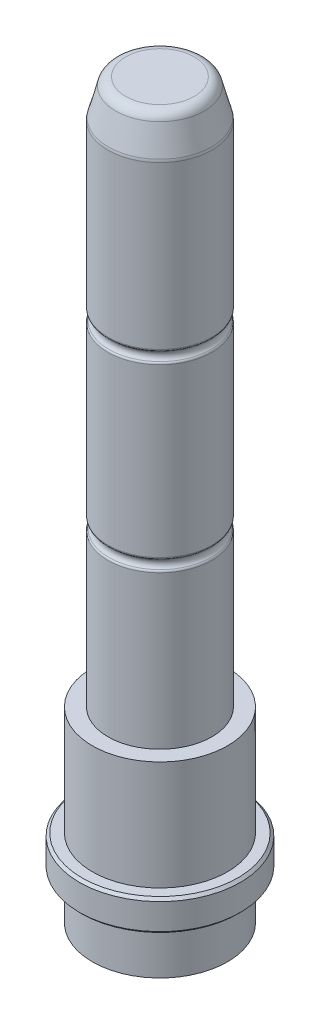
ISO-10303-21;
HEADER;
FILE_DESCRIPTION(('STEP AP214'),'2;1');
FILE_NAME('part.step','',(''),(''),'','','');
FILE_SCHEMA(('AUTOMOTIVE_DESIGN { 1 0 10303 214 1 1 1 1 }'));
ENDSEC;
DATA;
#1=APPLICATION_CONTEXT('core data for automotive mechanical design processes');
#2=APPLICATION_PROTOCOL_DEFINITION('international standard','automotive_design',2000,#1);
#3=PRODUCT_CONTEXT('',#1,'mechanical');
#4=PRODUCT('Part','Part','',(#3));
#5=PRODUCT_RELATED_PRODUCT_CATEGORY('part','',(#4));
#6=PRODUCT_DEFINITION_FORMATION('','',#4);
#7=PRODUCT_DEFINITION_CONTEXT('part definition',#1,'design');
#8=PRODUCT_DEFINITION('design','',#6,#7);
#9=PRODUCT_DEFINITION_SHAPE('','',#8);
#10=(LENGTH_UNIT() NAMED_UNIT(*) SI_UNIT(.MILLI.,.METRE.));
#11=(NAMED_UNIT(*) PLANE_ANGLE_UNIT() SI_UNIT($,.RADIAN.));
#12=(NAMED_UNIT(*) SI_UNIT($,.STERADIAN.) SOLID_ANGLE_UNIT());
#13=UNCERTAINTY_MEASURE_WITH_UNIT(LENGTH_MEASURE(1.E-05),#10,'distance_accuracy_value','');
#14=(GEOMETRIC_REPRESENTATION_CONTEXT(3) GLOBAL_UNCERTAINTY_ASSIGNED_CONTEXT((#13)) GLOBAL_UNIT_ASSIGNED_CONTEXT((#10,
#11,#12)) REPRESENTATION_CONTEXT('',''));
#15=CARTESIAN_POINT('',(0.,0.,0.));
#16=DIRECTION('',(0.,0.,1.));
#17=DIRECTION('',(1.,0.,0.));
#18=AXIS2_PLACEMENT_3D('',#15,#16,#17);
#19=CARTESIAN_POINT('',(0.,6.,0.));
#20=DIRECTION('',(0.,-1.,0.));
#21=DIRECTION('',(0.,0.,-1.));
#22=AXIS2_PLACEMENT_3D('',#19,#20,#21);
#23=CYLINDRICAL_SURFACE('',#22,15.5);
#24=CARTESIAN_POINT('',(0.,5.5,0.));
#25=DIRECTION('',(0.,1.,0.));
#26=DIRECTION('',(0.,0.,1.));
#27=AXIS2_PLACEMENT_3D('',#24,#25,#26);
#28=CIRCLE('',#27,15.5);
#29=CARTESIAN_POINT('',(0.,5.5,15.5));
#30=VERTEX_POINT('',#29);
#31=EDGE_CURVE('E22',#30,#30,#28,.F.);
#32=ORIENTED_EDGE('',*,*,#31,.T.);
#33=EDGE_LOOP('',(#32));
#34=FACE_BOUND('',#33,.T.);
#35=CARTESIAN_POINT('',(0.,0.5,0.));
#36=DIRECTION('',(0.,1.,0.));
#37=DIRECTION('',(0.,0.,1.));
#38=AXIS2_PLACEMENT_3D('',#35,#36,#37);
#39=CIRCLE('',#38,15.5);
#40=CARTESIAN_POINT('',(0.,0.5,15.5));
#41=VERTEX_POINT('',#40);
#42=EDGE_CURVE('E29',#41,#41,#39,.T.);
#43=ORIENTED_EDGE('',*,*,#42,.T.);
#44=EDGE_LOOP('',(#43));
#45=FACE_BOUND('',#44,.T.);
#46=ADVANCED_FACE('F14',(#34,#45),#23,.T.);
#47=CARTESIAN_POINT('',(0.,6.,0.));
#48=DIRECTION('',(0.,1.,0.));
#49=DIRECTION('',(0.,0.,1.));
#50=AXIS2_PLACEMENT_3D('',#47,#48,#49);
#51=PLANE('',#50);
#52=CARTESIAN_POINT('',(0.,6.,0.));
#53=DIRECTION('',(0.,1.,0.));
#54=DIRECTION('',(0.,0.,1.));
#55=AXIS2_PLACEMENT_3D('',#52,#53,#54);
#56=CIRCLE('',#55,15.);
#57=CARTESIAN_POINT('',(0.,6.,15.));
#58=VERTEX_POINT('',#57);
#59=EDGE_CURVE('E34',#58,#58,#56,.T.);
#60=ORIENTED_EDGE('',*,*,#59,.T.);
#61=EDGE_LOOP('',(#60));
#62=FACE_BOUND('',#61,.T.);
#63=CARTESIAN_POINT('',(0.,6.,0.));
#64=DIRECTION('',(0.,-1.,0.));
#65=DIRECTION('',(0.,0.,-1.));
#66=AXIS2_PLACEMENT_3D('',#63,#64,#65);
#67=CIRCLE('',#66,13.);
#68=CARTESIAN_POINT('',(0.,6.,-13.));
#69=VERTEX_POINT('',#68);
#70=EDGE_CURVE('E44',#69,#69,#67,.T.);
#71=ORIENTED_EDGE('',*,*,#70,.T.);
#72=EDGE_LOOP('',(#71));
#73=FACE_BOUND('',#72,.T.);
#74=ADVANCED_FACE('F125',(#62,#73),#51,.T.);
#75=CARTESIAN_POINT('',(0.,0.,0.));
#76=DIRECTION('',(0.,1.,0.));
#77=DIRECTION('',(0.,0.,1.));
#78=AXIS2_PLACEMENT_3D('',#75,#76,#77);
#79=PLANE('',#78);
#80=CARTESIAN_POINT('',(0.,0.,0.));
#81=DIRECTION('',(0.,1.,0.));
#82=DIRECTION('',(0.,0.,1.));
#83=AXIS2_PLACEMENT_3D('',#80,#81,#82);
#84=CIRCLE('',#83,15.);
#85=CARTESIAN_POINT('',(0.,0.,15.));
#86=VERTEX_POINT('',#85);
#87=EDGE_CURVE('E9',#86,#86,#84,.F.);
#88=ORIENTED_EDGE('',*,*,#87,.T.);
#89=EDGE_LOOP('',(#88));
#90=FACE_BOUND('',#89,.T.);
#91=CARTESIAN_POINT('',(0.,0.,0.));
#92=DIRECTION('',(0.,1.,0.));
#93=DIRECTION('',(0.,0.,1.));
#94=AXIS2_PLACEMENT_3D('',#91,#92,#93);
#95=CIRCLE('',#94,13.);
#96=CARTESIAN_POINT('',(0.,0.,13.));
#97=VERTEX_POINT('',#96);
#98=EDGE_CURVE('E103',#97,#97,#95,.T.);
#99=ORIENTED_EDGE('',*,*,#98,.T.);
#100=EDGE_LOOP('',(#99));
#101=FACE_BOUND('',#100,.T.);
#102=ADVANCED_FACE('F108',(#90,#101),#79,.F.);
#103=CARTESIAN_POINT('',(0.,27.,0.));
#104=DIRECTION('',(0.,-1.,0.));
#105=DIRECTION('',(0.,0.,-1.));
#106=AXIS2_PLACEMENT_3D('',#103,#104,#105);
#107=PLANE('',#106);
#108=CARTESIAN_POINT('',(0.,27.,0.));
#109=DIRECTION('',(0.,1.,0.));
#110=DIRECTION('',(0.,0.,1.));
#111=AXIS2_PLACEMENT_3D('',#108,#109,#110);
#112=CIRCLE('',#111,10.);
#113=CARTESIAN_POINT('',(0.,27.,9.99999999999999));
#114=VERTEX_POINT('',#113);
#115=EDGE_CURVE('E40',#114,#114,#112,.T.);
#116=ORIENTED_EDGE('',*,*,#115,.F.);
#117=EDGE_LOOP('',(#116));
#118=FACE_BOUND('',#117,.T.);
#119=CARTESIAN_POINT('',(0.,27.,0.));
#120=DIRECTION('',(0.,-1.,0.));
#121=DIRECTION('',(0.,0.,-1.));
#122=AXIS2_PLACEMENT_3D('',#119,#120,#121);
#123=CIRCLE('',#122,13.);
#124=CARTESIAN_POINT('',(0.,27.,-13.));
#125=VERTEX_POINT('',#124);
#126=EDGE_CURVE('E41',#125,#125,#123,.T.);
#127=ORIENTED_EDGE('',*,*,#126,.F.);
#128=EDGE_LOOP('',(#127));
#129=FACE_BOUND('',#128,.T.);
#130=ADVANCED_FACE('F134',(#118,#129),#107,.F.);
#131=CARTESIAN_POINT('',(0.,6.,0.));
#132=DIRECTION('',(0.,-1.,0.));
#133=DIRECTION('',(0.,0.,-1.));
#134=AXIS2_PLACEMENT_3D('',#131,#132,#133);
#135=CYLINDRICAL_SURFACE('',#134,13.);
#136=ORIENTED_EDGE('',*,*,#70,.F.);
#137=EDGE_LOOP('',(#136));
#138=FACE_BOUND('',#137,.T.);
#139=ORIENTED_EDGE('',*,*,#126,.T.);
#140=EDGE_LOOP('',(#139));
#141=FACE_BOUND('',#140,.T.);
#142=ADVANCED_FACE('F138',(#138,#141),#135,.T.);
#143=CARTESIAN_POINT('',(0.,132.,0.));
#144=DIRECTION('',(0.,1.,0.));
#145=DIRECTION('',(0.,0.,1.));
#146=AXIS2_PLACEMENT_3D('',#143,#144,#145);
#147=PLANE('',#146);
#148=CARTESIAN_POINT('',(0.,132.,0.));
#149=DIRECTION('',(0.,1.,0.));
#150=DIRECTION('',(0.,0.,1.));
#151=AXIS2_PLACEMENT_3D('',#148,#149,#150);
#152=CIRCLE('',#151,6.58970167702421);
#153=CARTESIAN_POINT('',(0.,132.,6.58970167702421));
#154=VERTEX_POINT('',#153);
#155=EDGE_CURVE('E48',#154,#154,#152,.T.);
#156=ORIENTED_EDGE('',*,*,#155,.T.);
#157=EDGE_LOOP('',(#156));
#158=FACE_BOUND('',#157,.T.);
#159=ADVANCED_FACE('F142',(#158),#147,.T.);
#160=CARTESIAN_POINT('',(0.,130.,0.));
#161=DIRECTION('',(0.,1.,0.));
#162=DIRECTION('',(0.,0.,1.));
#163=AXIS2_PLACEMENT_3D('',#160,#161,#162);
#164=TOROIDAL_SURFACE('',#163,6.58970167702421,2.);
#165=CARTESIAN_POINT('',(0.,130.517638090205,0.));
#166=DIRECTION('',(0.,1.,0.));
#167=DIRECTION('',(0.,0.,1.));
#168=AXIS2_PLACEMENT_3D('',#165,#166,#167);
#169=CIRCLE('',#168,8.52155332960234);
#170=CARTESIAN_POINT('',(0.,130.517638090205,8.52155332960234));
#171=VERTEX_POINT('',#170);
#172=EDGE_CURVE('E52',#171,#171,#169,.T.);
#173=ORIENTED_EDGE('',*,*,#172,.T.);
#174=EDGE_LOOP('',(#173));
#175=FACE_BOUND('',#174,.T.);
#176=ORIENTED_EDGE('',*,*,#155,.F.);
#177=EDGE_LOOP('',(#176));
#178=FACE_BOUND('',#177,.T.);
#179=ADVANCED_FACE('F146',(#175,#178),#164,.T.);
#180=CARTESIAN_POINT('',(0.,130.517638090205,0.));
#181=DIRECTION('',(0.,-1.,0.));
#182=DIRECTION('',(0.,0.,-1.));
#183=AXIS2_PLACEMENT_3D('',#180,#181,#182);
#184=CONICAL_SURFACE('',#183,8.52155332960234,0.261799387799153);
#185=CARTESIAN_POINT('',(0.,125.25433309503,0.));
#186=DIRECTION('',(0.,1.,0.));
#187=DIRECTION('',(0.,0.,1.));
#188=AXIS2_PLACEMENT_3D('',#185,#186,#187);
#189=CIRCLE('',#188,9.93185165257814);
#190=CARTESIAN_POINT('',(0.,125.25433309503,9.93185165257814));
#191=VERTEX_POINT('',#190);
#192=EDGE_CURVE('E56',#191,#191,#189,.T.);
#193=ORIENTED_EDGE('',*,*,#192,.T.);
#194=EDGE_LOOP('',(#193));
#195=FACE_BOUND('',#194,.T.);
#196=ORIENTED_EDGE('',*,*,#172,.F.);
#197=EDGE_LOOP('',(#196));
#198=FACE_BOUND('',#197,.T.);
#199=ADVANCED_FACE('F150',(#195,#198),#184,.T.);
#200=CARTESIAN_POINT('',(0.,124.736695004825,0.));
#201=DIRECTION('',(0.,1.,0.));
#202=DIRECTION('',(0.,0.,1.));
#203=AXIS2_PLACEMENT_3D('',#200,#201,#202);
#204=TOROIDAL_SURFACE('',#203,8.,2.);
#205=CARTESIAN_POINT('',(0.,124.736695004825,0.));
#206=DIRECTION('',(0.,1.,0.));
#207=DIRECTION('',(0.,0.,1.));
#208=AXIS2_PLACEMENT_3D('',#205,#206,#207);
#209=CIRCLE('',#208,10.);
#210=CARTESIAN_POINT('',(0.,124.736695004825,10.));
#211=VERTEX_POINT('',#210);
#212=EDGE_CURVE('E60',#211,#211,#209,.T.);
#213=ORIENTED_EDGE('',*,*,#212,.T.);
#214=EDGE_LOOP('',(#213));
#215=FACE_BOUND('',#214,.T.);
#216=ORIENTED_EDGE('',*,*,#192,.F.);
#217=EDGE_LOOP('',(#216));
#218=FACE_BOUND('',#217,.T.);
#219=ADVANCED_FACE('F154',(#215,#218),#204,.T.);
#220=CARTESIAN_POINT('',(0.,132.,0.));
#221=DIRECTION('',(0.,1.,0.));
#222=DIRECTION('',(0.,0.,1.));
#223=AXIS2_PLACEMENT_3D('',#220,#221,#222);
#224=CYLINDRICAL_SURFACE('',#223,10.);
#225=CARTESIAN_POINT('',(0.,93.6053529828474,0.));
#226=DIRECTION('',(0.,1.,0.));
#227=DIRECTION('',(0.,0.,1.));
#228=AXIS2_PLACEMENT_3D('',#225,#226,#227);
#229=CIRCLE('',#228,10.);
#230=CARTESIAN_POINT('',(0.,93.6053529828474,10.));
#231=VERTEX_POINT('',#230);
#232=EDGE_CURVE('E64',#231,#231,#229,.T.);
#233=ORIENTED_EDGE('',*,*,#232,.T.);
#234=EDGE_LOOP('',(#233));
#235=FACE_BOUND('',#234,.T.);
#236=ORIENTED_EDGE('',*,*,#212,.F.);
#237=EDGE_LOOP('',(#236));
#238=FACE_BOUND('',#237,.T.);
#239=ADVANCED_FACE('F158',(#235,#238),#224,.T.);
#240=CARTESIAN_POINT('',(0.,93.6053529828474,0.));
#241=DIRECTION('',(0.,1.,0.));
#242=DIRECTION('',(0.,0.,1.));
#243=AXIS2_PLACEMENT_3D('',#240,#241,#242);
#244=TOROIDAL_SURFACE('',#243,9.5,0.5);
#245=CARTESIAN_POINT('',(0.,93.2122772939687,0.));
#246=DIRECTION('',(0.,1.,0.));
#247=DIRECTION('',(0.,0.,1.));
#248=AXIS2_PLACEMENT_3D('',#245,#246,#247);
#249=CIRCLE('',#248,9.80901699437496);
#250=CARTESIAN_POINT('',(0.,93.2122772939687,9.80901699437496));
#251=VERTEX_POINT('',#250);
#252=EDGE_CURVE('E68',#251,#251,#249,.T.);
#253=ORIENTED_EDGE('',*,*,#252,.T.);
#254=EDGE_LOOP('',(#253));
#255=FACE_BOUND('',#254,.T.);
#256=ORIENTED_EDGE('',*,*,#232,.F.);
#257=EDGE_LOOP('',(#256));
#258=FACE_BOUND('',#257,.T.);
#259=ADVANCED_FACE('F162',(#255,#258),#244,.T.);
#260=CARTESIAN_POINT('',(0.,92.3333333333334,0.));
#261=DIRECTION('',(0.,1.,0.));
#262=DIRECTION('',(0.,0.,1.));
#263=AXIS2_PLACEMENT_3D('',#260,#261,#262);
#264=TOROIDAL_SURFACE('',#263,10.5,1.11803398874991);
#265=CARTESIAN_POINT('',(0.,91.454389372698,0.));
#266=DIRECTION('',(0.,1.,0.));
#267=DIRECTION('',(0.,0.,1.));
#268=AXIS2_PLACEMENT_3D('',#265,#266,#267);
#269=CIRCLE('',#268,9.80901699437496);
#270=CARTESIAN_POINT('',(0.,91.454389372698,9.80901699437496));
#271=VERTEX_POINT('',#270);
#272=EDGE_CURVE('E72',#271,#271,#269,.T.);
#273=ORIENTED_EDGE('',*,*,#272,.T.);
#274=EDGE_LOOP('',(#273));
#275=FACE_BOUND('',#274,.T.);
#276=ORIENTED_EDGE('',*,*,#252,.F.);
#277=EDGE_LOOP('',(#276));
#278=FACE_BOUND('',#277,.T.);
#279=ADVANCED_FACE('F166',(#275,#278),#264,.F.);
#280=CARTESIAN_POINT('',(0.,91.0613136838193,0.));
#281=DIRECTION('',(0.,1.,0.));
#282=DIRECTION('',(0.,0.,1.));
#283=AXIS2_PLACEMENT_3D('',#280,#281,#282);
#284=TOROIDAL_SURFACE('',#283,9.5,0.5);
#285=CARTESIAN_POINT('',(0.,91.0613136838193,0.));
#286=DIRECTION('',(0.,1.,0.));
#287=DIRECTION('',(0.,0.,1.));
#288=AXIS2_PLACEMENT_3D('',#285,#286,#287);
#289=CIRCLE('',#288,10.);
#290=CARTESIAN_POINT('',(0.,91.0613136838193,10.));
#291=VERTEX_POINT('',#290);
#292=EDGE_CURVE('E76',#291,#291,#289,.T.);
#293=ORIENTED_EDGE('',*,*,#292,.T.);
#294=EDGE_LOOP('',(#293));
#295=FACE_BOUND('',#294,.T.);
#296=ORIENTED_EDGE('',*,*,#272,.F.);
#297=EDGE_LOOP('',(#296));
#298=FACE_BOUND('',#297,.T.);
#299=ADVANCED_FACE('F170',(#295,#298),#284,.T.);
#300=CARTESIAN_POINT('',(0.,132.,0.));
#301=DIRECTION('',(0.,1.,0.));
#302=DIRECTION('',(0.,0.,1.));
#303=AXIS2_PLACEMENT_3D('',#300,#301,#302);
#304=CYLINDRICAL_SURFACE('',#303,10.);
#305=CARTESIAN_POINT('',(0.,58.9386863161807,0.));
#306=DIRECTION('',(0.,1.,0.));
#307=DIRECTION('',(0.,0.,1.));
#308=AXIS2_PLACEMENT_3D('',#305,#306,#307);
#309=CIRCLE('',#308,10.);
#310=CARTESIAN_POINT('',(0.,58.9386863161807,9.99999999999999));
#311=VERTEX_POINT('',#310);
#312=EDGE_CURVE('E80',#311,#311,#309,.T.);
#313=ORIENTED_EDGE('',*,*,#312,.T.);
#314=EDGE_LOOP('',(#313));
#315=FACE_BOUND('',#314,.T.);
#316=ORIENTED_EDGE('',*,*,#292,.F.);
#317=EDGE_LOOP('',(#316));
#318=FACE_BOUND('',#317,.T.);
#319=ADVANCED_FACE('F174',(#315,#318),#304,.T.);
#320=CARTESIAN_POINT('',(0.,58.9386863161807,0.));
#321=DIRECTION('',(0.,1.,0.));
#322=DIRECTION('',(0.,0.,1.));
#323=AXIS2_PLACEMENT_3D('',#320,#321,#322);
#324=TOROIDAL_SURFACE('',#323,9.5,0.5);
#325=CARTESIAN_POINT('',(0.,58.545610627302,0.));
#326=DIRECTION('',(0.,1.,0.));
#327=DIRECTION('',(0.,0.,1.));
#328=AXIS2_PLACEMENT_3D('',#325,#326,#327);
#329=CIRCLE('',#328,9.80901699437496);
#330=CARTESIAN_POINT('',(0.,58.545610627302,9.80901699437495));
#331=VERTEX_POINT('',#330);
#332=EDGE_CURVE('E84',#331,#331,#329,.T.);
#333=ORIENTED_EDGE('',*,*,#332,.T.);
#334=EDGE_LOOP('',(#333));
#335=FACE_BOUND('',#334,.T.);
#336=ORIENTED_EDGE('',*,*,#312,.F.);
#337=EDGE_LOOP('',(#336));
#338=FACE_BOUND('',#337,.T.);
#339=ADVANCED_FACE('F178',(#335,#338),#324,.T.);
#340=CARTESIAN_POINT('',(0.,57.6666666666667,0.));
#341=DIRECTION('',(0.,1.,0.));
#342=DIRECTION('',(0.,0.,1.));
#343=AXIS2_PLACEMENT_3D('',#340,#341,#342);
#344=TOROIDAL_SURFACE('',#343,10.5,1.11803398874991);
#345=CARTESIAN_POINT('',(0.,56.7877227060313,0.));
#346=DIRECTION('',(0.,1.,0.));
#347=DIRECTION('',(0.,0.,1.));
#348=AXIS2_PLACEMENT_3D('',#345,#346,#347);
#349=CIRCLE('',#348,9.80901699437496);
#350=CARTESIAN_POINT('',(0.,56.7877227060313,9.80901699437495));
#351=VERTEX_POINT('',#350);
#352=EDGE_CURVE('E88',#351,#351,#349,.T.);
#353=ORIENTED_EDGE('',*,*,#352,.T.);
#354=EDGE_LOOP('',(#353));
#355=FACE_BOUND('',#354,.T.);
#356=ORIENTED_EDGE('',*,*,#332,.F.);
#357=EDGE_LOOP('',(#356));
#358=FACE_BOUND('',#357,.T.);
#359=ADVANCED_FACE('F182',(#355,#358),#344,.F.);
#360=CARTESIAN_POINT('',(0.,56.3946470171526,0.));
#361=DIRECTION('',(0.,1.,0.));
#362=DIRECTION('',(0.,0.,1.));
#363=AXIS2_PLACEMENT_3D('',#360,#361,#362);
#364=TOROIDAL_SURFACE('',#363,9.5,0.5);
#365=CARTESIAN_POINT('',(0.,56.3946470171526,0.));
#366=DIRECTION('',(0.,1.,0.));
#367=DIRECTION('',(0.,0.,1.));
#368=AXIS2_PLACEMENT_3D('',#365,#366,#367);
#369=CIRCLE('',#368,10.);
#370=CARTESIAN_POINT('',(0.,56.3946470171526,9.99999999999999));
#371=VERTEX_POINT('',#370);
#372=EDGE_CURVE('E92',#371,#371,#369,.T.);
#373=ORIENTED_EDGE('',*,*,#372,.T.);
#374=EDGE_LOOP('',(#373));
#375=FACE_BOUND('',#374,.T.);
#376=ORIENTED_EDGE('',*,*,#352,.F.);
#377=EDGE_LOOP('',(#376));
#378=FACE_BOUND('',#377,.T.);
#379=ADVANCED_FACE('F186',(#375,#378),#364,.T.);
#380=CARTESIAN_POINT('',(0.,132.,0.));
#381=DIRECTION('',(0.,1.,0.));
#382=DIRECTION('',(0.,0.,1.));
#383=AXIS2_PLACEMENT_3D('',#380,#381,#382);
#384=CYLINDRICAL_SURFACE('',#383,10.);
#385=ORIENTED_EDGE('',*,*,#115,.T.);
#386=EDGE_LOOP('',(#385));
#387=FACE_BOUND('',#386,.T.);
#388=ORIENTED_EDGE('',*,*,#372,.F.);
#389=EDGE_LOOP('',(#388));
#390=FACE_BOUND('',#389,.T.);
#391=ADVANCED_FACE('F121',(#387,#390),#384,.T.);
#392=CARTESIAN_POINT('',(0.,-9.,0.));
#393=DIRECTION('',(0.,-1.,0.));
#394=DIRECTION('',(0.,0.,-1.));
#395=AXIS2_PLACEMENT_3D('',#392,#393,#394);
#396=PLANE('',#395);
#397=CARTESIAN_POINT('',(0.,-9.,0.));
#398=DIRECTION('',(0.,1.,0.));
#399=DIRECTION('',(0.,0.,1.));
#400=AXIS2_PLACEMENT_3D('',#397,#398,#399);
#401=CIRCLE('',#400,13.);
#402=CARTESIAN_POINT('',(0.,-9.,13.));
#403=VERTEX_POINT('',#402);
#404=EDGE_CURVE('E96',#403,#403,#401,.T.);
#405=ORIENTED_EDGE('',*,*,#404,.F.);
#406=EDGE_LOOP('',(#405));
#407=FACE_BOUND('',#406,.T.);
#408=ADVANCED_FACE('F113',(#407),#396,.T.);
#409=CARTESIAN_POINT('',(0.,0.,0.));
#410=DIRECTION('',(0.,1.,0.));
#411=DIRECTION('',(0.,0.,1.));
#412=AXIS2_PLACEMENT_3D('',#409,#410,#411);
#413=CYLINDRICAL_SURFACE('',#412,13.);
#414=ORIENTED_EDGE('',*,*,#404,.T.);
#415=EDGE_LOOP('',(#414));
#416=FACE_BOUND('',#415,.T.);
#417=ORIENTED_EDGE('',*,*,#98,.F.);
#418=EDGE_LOOP('',(#417));
#419=FACE_BOUND('',#418,.T.);
#420=ADVANCED_FACE('F110',(#416,#419),#413,.T.);
#421=CARTESIAN_POINT('',(0.,6.,0.));
#422=DIRECTION('',(0.,-1.,0.));
#423=DIRECTION('',(0.,0.,-1.));
#424=AXIS2_PLACEMENT_3D('',#421,#422,#423);
#425=CONICAL_SURFACE('',#424,15.,0.78539816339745);
#426=ORIENTED_EDGE('',*,*,#31,.F.);
#427=EDGE_LOOP('',(#426));
#428=FACE_BOUND('',#427,.T.);
#429=ORIENTED_EDGE('',*,*,#59,.F.);
#430=EDGE_LOOP('',(#429));
#431=FACE_BOUND('',#430,.T.);
#432=ADVANCED_FACE('F112',(#428,#431),#425,.T.);
#433=CARTESIAN_POINT('',(0.,0.5,0.));
#434=DIRECTION('',(0.,1.,0.));
#435=DIRECTION('',(0.,0.,1.));
#436=AXIS2_PLACEMENT_3D('',#433,#434,#435);
#437=CONICAL_SURFACE('',#436,15.5,0.78539816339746);
#438=ORIENTED_EDGE('',*,*,#87,.F.);
#439=EDGE_LOOP('',(#438));
#440=FACE_BOUND('',#439,.T.);
#441=ORIENTED_EDGE('',*,*,#42,.F.);
#442=EDGE_LOOP('',(#441));
#443=FACE_BOUND('',#442,.T.);
#444=ADVANCED_FACE('F16',(#440,#443),#437,.T.);
#445=CLOSED_SHELL('',(#46,#74,#102,#130,#142,#159,#179,#199,#219,#239,#259,#279,#299,#319,#339,
#359,#379,#391,#408,#420,#432,#444));
#446=MANIFOLD_SOLID_BREP('B1',#445);
#447=ADVANCED_BREP_SHAPE_REPRESENTATION('',(#18,#446),#14);
#448=SHAPE_DEFINITION_REPRESENTATION(#9,#447);
ENDSEC;
END-ISO-10303-21;
